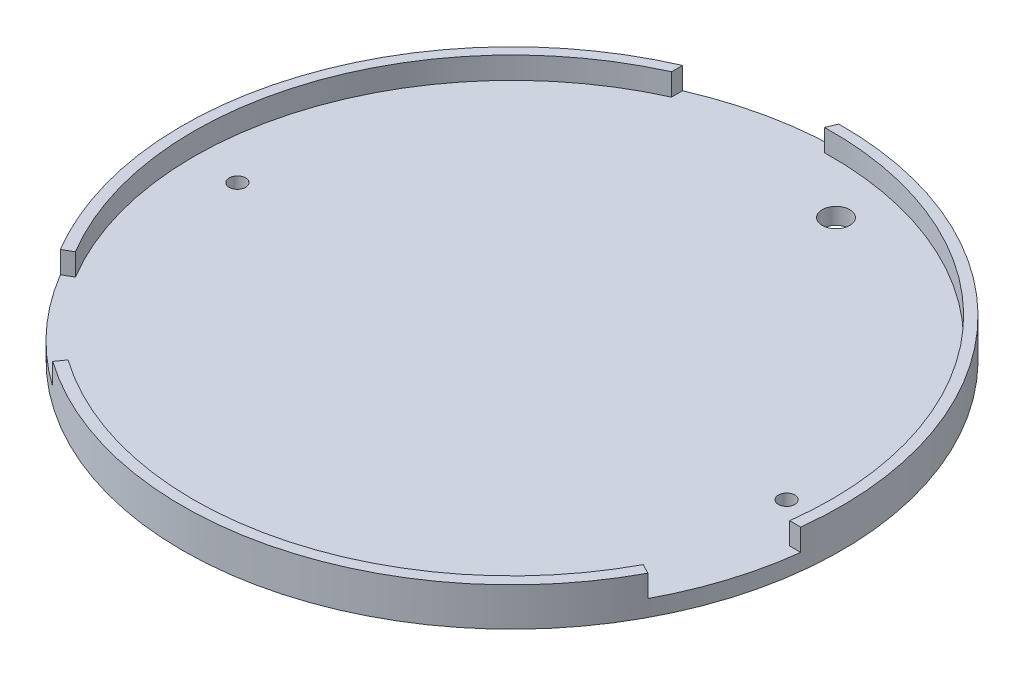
from build123d import *
from build123d.topology import SkipClean

# Parameters (mm, degrees)
SKETCH1_R           = 60
BOSS_EXTRUDE1_DEPTH = 3
CUT_EXTRUDE1_REACH  = 86.906
SKETCH2_R           = 1.5
SKETCH2_R_2         = 2.5
BOSS_EXTRUDE2_DEPTH = 7


with BuildPart() as part:
    # Sketch1 → Boss-Extrude1 (new body)
    with BuildSketch(Plane(origin=(0, 0, 0), x_dir=(1, 0, 0), z_dir=(0, 1, 0))):
        with Locations(Location((0, 0, 0), (0, 0, 270))):
            Circle(SKETCH1_R)
    extrude(amount=BOSS_EXTRUDE1_DEPTH)

    # Sketch2 → Cut-Extrude1 (cut, up to next)
    with BuildSketch(Plane(origin=(0, 3, 0), x_dir=(1, 0, 0), z_dir=(0, 1, 0)), mode=Mode.PRIVATE) as cut_extrude1_sk1:
        with Locations(Location((50, 0, 0), (0, 0, 270))):
            Circle(SKETCH2_R)
    cut_extrude1_tool1 = extrude(cut_extrude1_sk1.sketch, amount=-CUT_EXTRUDE1_REACH, mode=Mode.PRIVATE) & part.part
    # Sketch2 → Cut-Extrude1 (cut, up to next)
    with BuildSketch(Plane(origin=(0, 3, 0), x_dir=(1, 0, 0), z_dir=(0, 1, 0)), mode=Mode.PRIVATE) as cut_extrude1_sk2:
        with Locations(Location((-50, 0, 0), (0, 0, 270))):
            Circle(SKETCH2_R)
    cut_extrude1_tool2 = extrude(cut_extrude1_sk2.sketch, amount=-CUT_EXTRUDE1_REACH, mode=Mode.PRIVATE) & part.part
    # Sketch2 → Cut-Extrude1 (cut, up to next)
    with BuildSketch(Plane(origin=(0, 3, 0), x_dir=(1, 0, 0), z_dir=(0, 1, 0)), mode=Mode.PRIVATE) as cut_extrude1_sk3:
        with Locations(Location((10, 48.989794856, 0), (0, 0, 270))):
            Circle(SKETCH2_R_2)
    cut_extrude1_tool3 = extrude(cut_extrude1_sk3.sketch, amount=-CUT_EXTRUDE1_REACH, mode=Mode.PRIVATE) & part.part
    add(cut_extrude1_tool1.solids().sort_by_distance((50, 3, 0))[0], mode=Mode.SUBTRACT)
    add(cut_extrude1_tool2.solids().sort_by_distance((-50, 3, 0))[0], mode=Mode.SUBTRACT)
    add(cut_extrude1_tool3.solids().sort_by_distance((10, 3, -48.989795))[0], mode=Mode.SUBTRACT)

    # Sketch3 → Boss-Extrude2 (add)
    with SkipClean():  # the faces are left unmerged after this step: merging them gives an invalid solid
        with BuildSketch(Plane(origin=(0, 0, 0), x_dir=(-1, 0, 0), z_dir=(0, -1, 0))):
            with BuildLine():
                Line((34.617869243, -49.006153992), (33.463940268, -47.372615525))
                ThreePointArc((33.463940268, -47.372615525), (-13.395145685, -56.43199511), (-51.184052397, -27.279896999))
                Line((-51.184052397, -27.279896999), (-52.949019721, -28.220583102))
                ThreePointArc((-52.949019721, -28.220583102), (-13.85704726, -58.377925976), (34.617869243, -49.006153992))
            make_face()
            with BuildLine():
                Line((51.584035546, -30.644530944), (49.848216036, -29.651087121))
                ThreePointArc((49.848216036, -29.651087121), (55.437182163, 17.48520169), (23.956173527, 53.010014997))
                Line((23.956173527, 53.010014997), (23.956173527, 55.010014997))
                ThreePointArc((23.956173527, 55.010014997), (57.103030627, 18.41857468), (51.584035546, -30.644530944))
            make_face()
            with BuildLine():
                Line((0.480244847, 59.99807801), (1.261586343, 58.157017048))
                ThreePointArc((1.261586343, 58.157017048), (-43.085154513, 39.039608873), (-57.587528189, -7.023281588))
                Line((-57.587528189, -7.023281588), (-59.587528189, -7.023281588))
                ThreePointArc((-59.587528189, -7.023281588), (-44.680906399, 40.045182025), (0.480244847, 59.99807801))
            make_face()
        extrude(amount=-BOSS_EXTRUDE2_DEPTH)


solid = part.part
